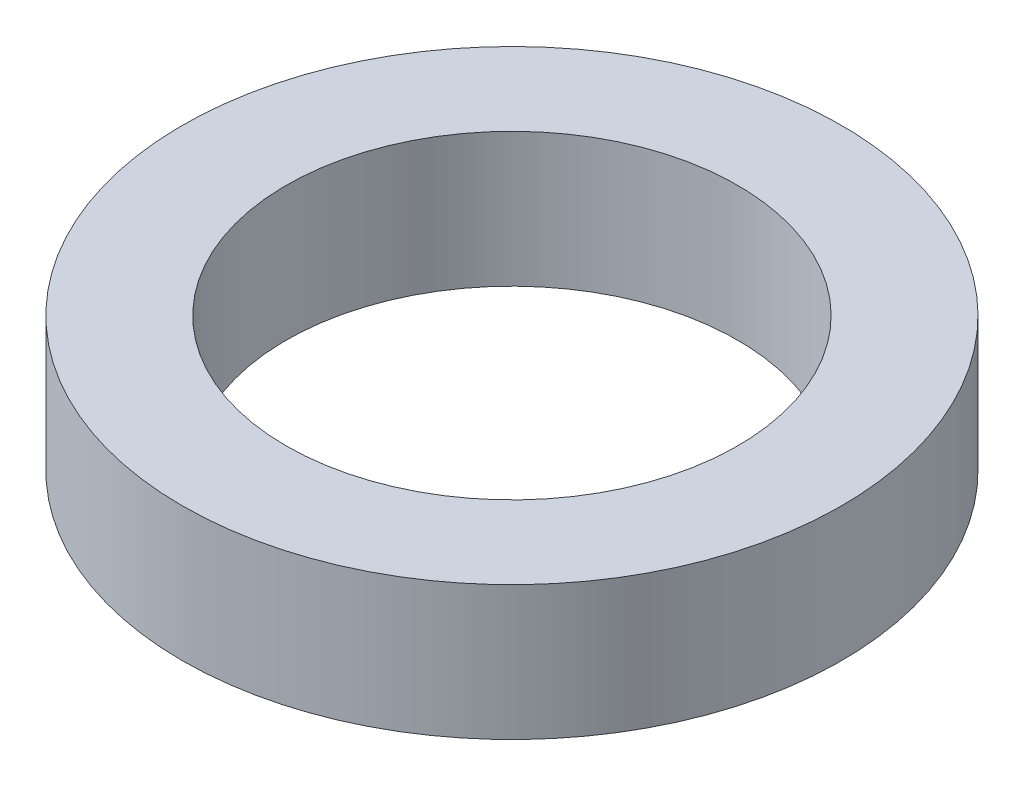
from build123d import *

# Parameters (mm, degrees)
SKETCH1_R      = 5.8039
SKETCH1_R_2    = 3.9751
EXTRUDE1_DEPTH = 2.3622


with BuildPart() as part:
    # Sketch1 → Extrude1 (new body)
    with BuildSketch(Plane(origin=(0, 0, 0), x_dir=(1, 0, 0), z_dir=(0, 1, 0))):
        with Locations(Location((0, 0, 0), (0, 0, 270))):
            Circle(SKETCH1_R)
        with Locations(Location((0, 0, 0), (0, 0, 270))):
            Circle(SKETCH1_R_2, mode=Mode.SUBTRACT)
    extrude(amount=EXTRUDE1_DEPTH)


solid = part.part
